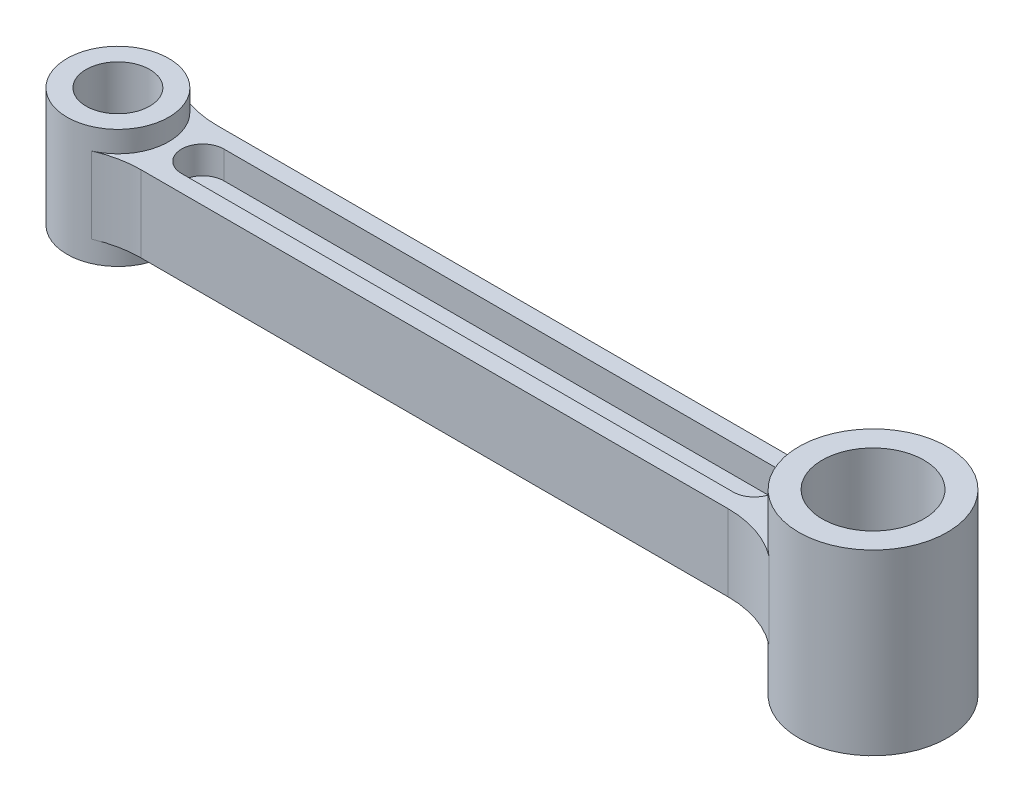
from build123d import *

# Parameters (mm, degrees)
SKETCH1_R           = 12
SKETCH1_R_2         = 7.5
BOSS_EXTRUDE1_DEPTH = 14
SKETCH1_3_R         = 17.5
SKETCH1_3_R_2       = 12
BOSS_EXTRUDE2_DEPTH = 21
BOSS_EXTRUDE3_DEPTH = 9
CUT_EXTRUDE1_DEPTH  = 6.5
FILLET1_R           = 24


with BuildPart() as part:
    # Sketch1 → Boss-Extrude1 (new, symmetric)
    with BuildSketch(Plane(origin=(0, 0, 0), x_dir=(1, 0, 0), z_dir=(0, 1, 0))):
        with Locations(Location((-178, 0, 0), (0, 0, 270))):
            Circle(SKETCH1_R)
        with Locations(Location((-178, 0, 0), (0, 0, 270))):
            Circle(SKETCH1_R_2, mode=Mode.SUBTRACT)
    extrude(amount=BOSS_EXTRUDE1_DEPTH, both=True)



with BuildPart() as body_2:
    # Sketch1_3 → Boss-Extrude2 (new, symmetric)
    with BuildSketch(Plane(origin=(0, 0, 0), x_dir=(1, 0, 0), z_dir=(0, 1, 0))):
        with Locations(Location((0, 0, 0), (0, 0, 90))):
            Circle(SKETCH1_3_R)
        with Locations(Location((0, 0, 0), (0, 0, 90))):
            Circle(SKETCH1_3_R_2, mode=Mode.SUBTRACT)
    extrude(amount=BOSS_EXTRUDE2_DEPTH, both=True)


with BuildPart() as part_1:
    add(part.part)

    add(body_2.part)  # Boss-Extrude3 merges body 2
    # Sketch1_4 → Boss-Extrude3 (add, symmetric)
    with BuildSketch(Plane(origin=(0, 0, 0), x_dir=(1, 0, 0), z_dir=(0, 1, 0))):
        with BuildLine():
            Line((-17.5, 0), (-166, 0))
            ThreePointArc((-166, 0), (-167.062746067, -4.937253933), (-170.062746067, -9))
            Line((-170.062746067, -9), (-15.00833102, -9))
            ThreePointArc((-15.00833102, -9), (-16.865583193, -4.669272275), (-17.5, 0))
        make_face()
        with BuildLine():
            ThreePointArc((-170.062746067, 9), (-167.062746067, 4.937253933), (-166, 0))
            Line((-166, 0), (-17.5, 0))
            ThreePointArc((-17.5, 0), (-16.865583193, 4.669272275), (-15.00833102, 9))
            Line((-15.00833102, 9), (-170.062746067, 9))
        make_face()
    extrude(amount=BOSS_EXTRUDE3_DEPTH, both=True)

    # Sketch2 → Cut-Extrude1 (cut)
    with BuildSketch(Plane(origin=(0, 9, 0), x_dir=(1, 0, 0), z_dir=(0, 1, 0))):
        with BuildLine():
            Line((-158, 5), (-28, 5))
            ThreePointArc((-28, 5), (-23, 0), (-28, -5))
            Line((-28, -5), (-158, -5))
            ThreePointArc((-158, -5), (-163, 0), (-158, 5))
        make_face()
    cut_extrude1 = extrude(amount=-CUT_EXTRUDE1_DEPTH, mode=Mode.SUBTRACT)

    # Mirror1: Cut-Extrude1 across plane
    add(cut_extrude1.mirror(Plane.ZX), mode=Mode.SUBTRACT)

    # Fillet1
    fillet1_edges = [part_1.edges().sort_by_distance(p)[0] for p in [
        (-15.00833102, 0, 9),
        (-15.00833102, 0, -9),
        (-170.062746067, 0, -9),
        (-170.062746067, 0, 9),
    ]]
    fillet(fillet1_edges, radius=FILLET1_R)


solid = part_1.part
